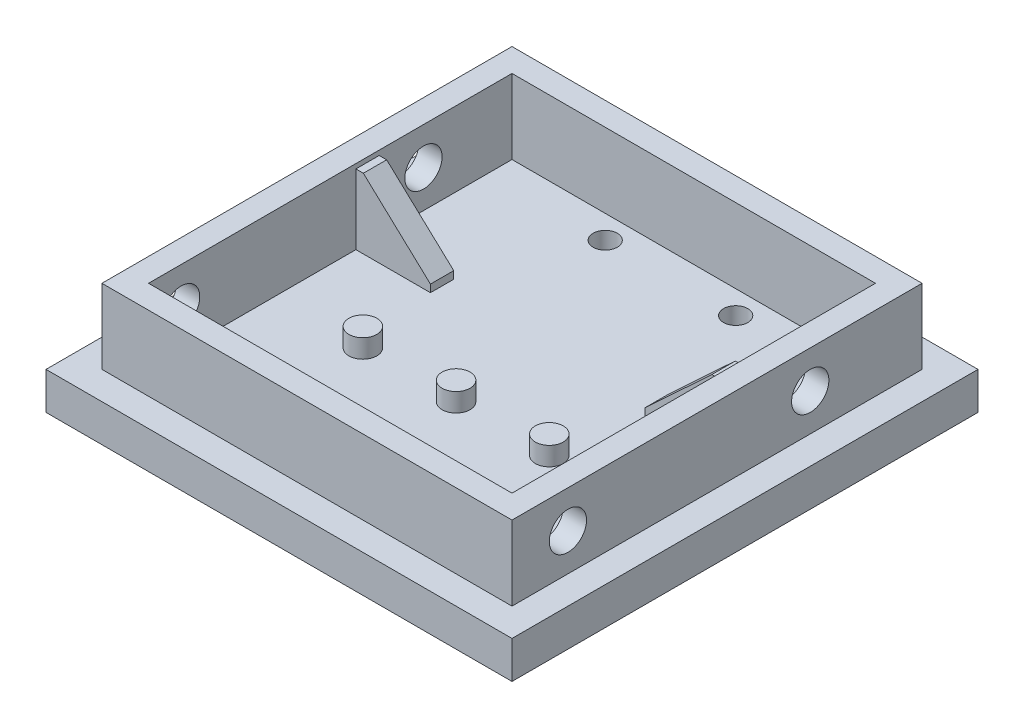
from build123d import *

# Parameters (mm, degrees)
SKETCH_1_W          = 50
SKETCH_1_H          = 50
EXTRUDE_1_DEPTH     = 4
SKETCH_3_R          = 1.3
CUT_EXTRUDE_1_DEPTH = 4
SKETCH_4_W          = 44
SKETCH_4_H          = 44
SKETCH_4_W_2        = 39
SKETCH_4_H_2        = 39
EXTRUDE_2_DEPTH     = 8
SKETCH_6_R          = 1.5
EXTRUDE_3_DEPTH     = 2
SKETCH_7_R          = 2
CUT_EXTRUDE_2_DEPTH = 55.571054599
EXTRUDE_START       = -4
EXTRUDE_4_DEPTH     = 1.25


with BuildPart() as part:
    # Sketch 1 → Extrude 1 (new body)
    with BuildSketch(Plane(origin=(0, 0, 0), x_dir=(1, 0, 0), z_dir=(0, 1, 0))):
        Rectangle(SKETCH_1_W, SKETCH_1_H)
    extrude(amount=EXTRUDE_1_DEPTH)

    # Sketch 3 → Cut-Extrude 1 (cut)
    with BuildSketch(Plane(origin=(0, 4, 0), x_dir=(1, 0, 0), z_dir=(0, 1, 0))):
        with Locations(Location((-7, 17, 0), (0, 0, 270))):
            Circle(SKETCH_3_R)
        with Locations(Location((7, 17, 0), (0, 0, 270))):
            Circle(SKETCH_3_R)
    extrude(amount=-CUT_EXTRUDE_1_DEPTH, mode=Mode.SUBTRACT)

    # Sketch 4 → Extrude 2 (add)
    with BuildSketch(Plane(origin=(0, 4, 0), x_dir=(1, 0, 0), z_dir=(0, 1, 0))):
        Rectangle(SKETCH_4_W, SKETCH_4_H)
        Rectangle(SKETCH_4_W_2, SKETCH_4_H_2, mode=Mode.SUBTRACT)
    extrude(amount=EXTRUDE_2_DEPTH)

    # Sketch 6 → Extrude 3 (add)
    with BuildSketch(Plane(origin=(0, 4, 0), x_dir=(1, 0, 0), z_dir=(0, 1, 0))):
        with Locations(Location((0, -6, 0), (0, 0, 90))):
            Circle(SKETCH_6_R)
        with Locations(Location((10, -6, 0), (0, 0, 90))):
            Circle(SKETCH_6_R)
        with Locations(Location((-10, -6, 0), (0, 0, 90))):
            Circle(SKETCH_6_R)
    extrude(amount=EXTRUDE_3_DEPTH)

    # Sketch 7 → Cut-Extrude 2 (cut, through all)
    with BuildSketch(Plane.ZY.offset(22)):
        with Locations((16, 8)):
            Circle(SKETCH_7_R)
        with Locations((-10, 8)):
            Circle(SKETCH_7_R)
    extrude(amount=-CUT_EXTRUDE_2_DEPTH, mode=Mode.SUBTRACT)

    # Sketch 8 → Extrude 4 (add, symmetric)
    with BuildSketch(Plane.XY.offset(EXTRUDE_START)):
        Polygon((-19.5, 11.5), (-18.7, 11.5), (-11.5, 4.8), (-11.5, 4), (-19.5, 4), align=None)
        Polygon((19.5, 4), (19.5, 11.5), (18.7, 11.5), (11.5, 4.8), (11.5, 4), align=None)
    extrude(amount=EXTRUDE_4_DEPTH, both=True)


solid = part.part
